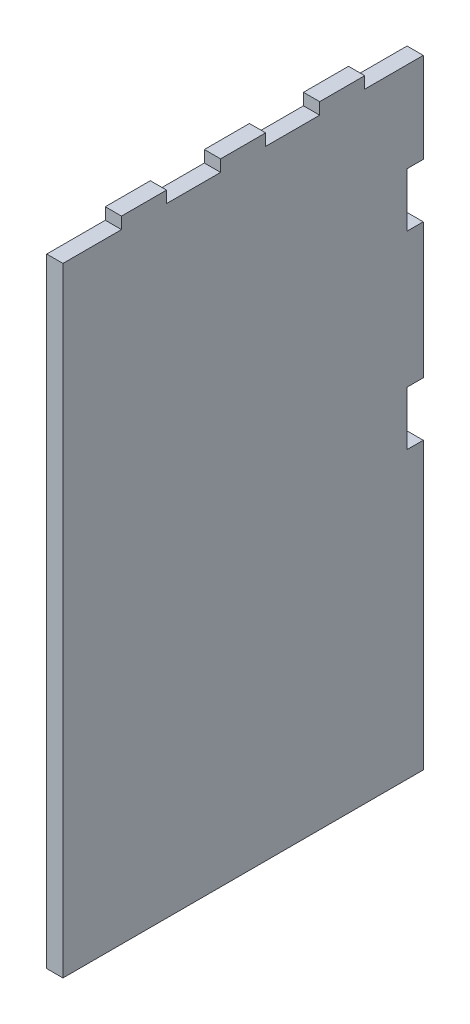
from build123d import *

# Parameters (mm, degrees)
SKETCH1_W           = 400
SKETCH1_H           = 700
BOSS_EXTRUDE1_DEPTH = 18
SKETCH2_W           = 65
SKETCH2_H           = 13
SKETCH2_W_2         = 60
CUT_EXTRUDE1_DEPTH  = 18
SKETCH3_W           = 18
SKETCH3_H           = 60
CUT_EXTRUDE3_DEPTH  = 18


with BuildPart() as part:
    # Sketch1 → Boss-Extrude1 (new body)
    with BuildSketch(Plane(origin=(0, 0, 0), x_dir=(0, 0, -1), z_dir=(1, 0, 0))):
        Rectangle(SKETCH1_W, SKETCH1_H)
    extrude(amount=BOSS_EXTRUDE1_DEPTH)

    # Sketch2 → Cut-Extrude1 (cut)
    with BuildSketch(Plane(origin=(0, 0, 0), x_dir=(0, 0, -1), z_dir=(1, 0, 0))):
        with Locations((-167.5, 343.5)):
            Rectangle(SKETCH2_W, SKETCH2_H)
        with Locations((-55, 343.5)):
            Rectangle(SKETCH2_W_2, SKETCH2_H)
        with Locations((55, 343.5)):
            Rectangle(SKETCH2_W_2, SKETCH2_H)
        with Locations((167.5, 343.5)):
            Rectangle(SKETCH2_W, SKETCH2_H)
    extrude(amount=CUT_EXTRUDE1_DEPTH, mode=Mode.SUBTRACT)

    # Sketch3 → Cut-Extrude3 (cut)
    with BuildSketch(Plane(origin=(0, 0, 0), x_dir=(0, 0, -1), z_dir=(1, 0, 0))):
        with Locations((191, 207)):
            Rectangle(SKETCH3_W, SKETCH3_H)
        with Locations((191, -3)):
            Rectangle(SKETCH3_W, SKETCH3_H)
    extrude(amount=CUT_EXTRUDE3_DEPTH, mode=Mode.SUBTRACT)


solid = part.part
